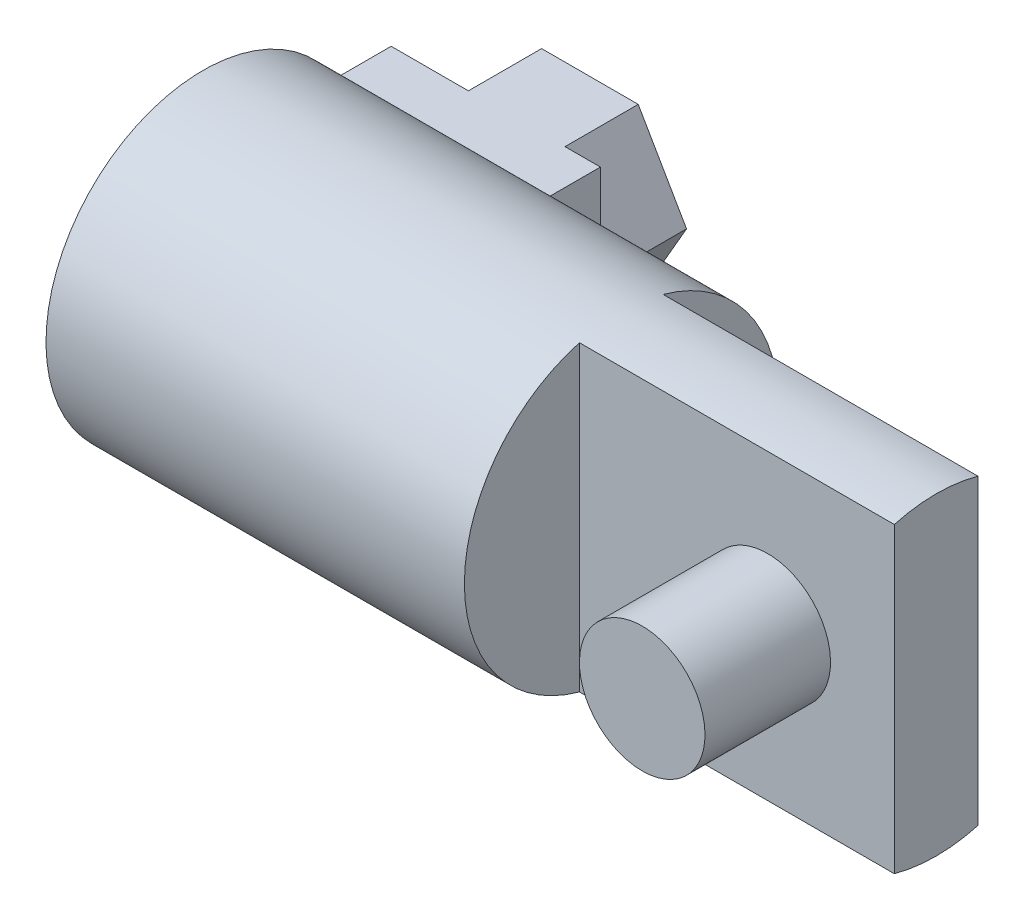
ISO-10303-21;
HEADER;
FILE_DESCRIPTION(('STEP AP214'),'2;1');
FILE_NAME('part.step','',(''),(''),'','','');
FILE_SCHEMA(('AUTOMOTIVE_DESIGN { 1 0 10303 214 1 1 1 1 }'));
ENDSEC;
DATA;
#1=APPLICATION_CONTEXT('core data for automotive mechanical design processes');
#2=APPLICATION_PROTOCOL_DEFINITION('international standard','automotive_design',2000,#1);
#3=PRODUCT_CONTEXT('',#1,'mechanical');
#4=PRODUCT('Part','Part','',(#3));
#5=PRODUCT_RELATED_PRODUCT_CATEGORY('part','',(#4));
#6=PRODUCT_DEFINITION_FORMATION('','',#4);
#7=PRODUCT_DEFINITION_CONTEXT('part definition',#1,'design');
#8=PRODUCT_DEFINITION('design','',#6,#7);
#9=PRODUCT_DEFINITION_SHAPE('','',#8);
#10=(LENGTH_UNIT() NAMED_UNIT(*) SI_UNIT(.MILLI.,.METRE.));
#11=(NAMED_UNIT(*) PLANE_ANGLE_UNIT() SI_UNIT($,.RADIAN.));
#12=(NAMED_UNIT(*) SI_UNIT($,.STERADIAN.) SOLID_ANGLE_UNIT());
#13=UNCERTAINTY_MEASURE_WITH_UNIT(LENGTH_MEASURE(1.E-05),#10,'distance_accuracy_value','');
#14=(GEOMETRIC_REPRESENTATION_CONTEXT(3) GLOBAL_UNCERTAINTY_ASSIGNED_CONTEXT((#13)) GLOBAL_UNIT_ASSIGNED_CONTEXT((#10,
#11,#12)) REPRESENTATION_CONTEXT('',''));
#15=CARTESIAN_POINT('',(0.,0.,0.));
#16=DIRECTION('',(0.,0.,1.));
#17=DIRECTION('',(1.,0.,0.));
#18=AXIS2_PLACEMENT_3D('',#15,#16,#17);
#19=CARTESIAN_POINT('',(-9.,10.,-4.));
#20=DIRECTION('',(0.,0.,1.));
#21=DIRECTION('',(0.,1.,0.));
#22=AXIS2_PLACEMENT_3D('',#19,#20,#21);
#23=PLANE('',#22);
#24=DIRECTION('',(1.,0.,0.));
#25=VECTOR('',#24,1.);
#26=CARTESIAN_POINT('',(50.,-7.22841614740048,-4.));
#27=LINE('',#26,#25);
#28=CARTESIAN_POINT('',(6.05,-7.22841614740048,-4.));
#29=VERTEX_POINT('',#28);
#30=CARTESIAN_POINT('',(-9.,-7.22841614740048,-4.));
#31=VERTEX_POINT('',#30);
#32=EDGE_CURVE('E231',#29,#31,#27,.F.);
#33=ORIENTED_EDGE('',*,*,#32,.T.);
#34=DIRECTION('',(0.,-1.,0.));
#35=VECTOR('',#34,1.);
#36=CARTESIAN_POINT('',(-9.,10.,-4.));
#37=LINE('',#36,#35);
#38=CARTESIAN_POINT('',(-9.,7.22841614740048,-4.));
#39=VERTEX_POINT('',#38);
#40=EDGE_CURVE('E245',#39,#31,#37,.T.);
#41=ORIENTED_EDGE('',*,*,#40,.F.);
#42=DIRECTION('',(1.,0.,0.));
#43=VECTOR('',#42,1.);
#44=CARTESIAN_POINT('',(50.,7.22841614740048,-4.));
#45=LINE('',#44,#43);
#46=CARTESIAN_POINT('',(6.05,7.22841614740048,-4.));
#47=VERTEX_POINT('',#46);
#48=EDGE_CURVE('E234',#39,#47,#45,.T.);
#49=ORIENTED_EDGE('',*,*,#48,.T.);
#50=DIRECTION('',(0.,-1.,0.));
#51=VECTOR('',#50,1.);
#52=CARTESIAN_POINT('',(6.05,10.,-4.));
#53=LINE('',#52,#51);
#54=EDGE_CURVE('E247',#47,#29,#53,.T.);
#55=ORIENTED_EDGE('',*,*,#54,.T.);
#56=EDGE_LOOP('',(#33,#41,#49,#55));
#57=FACE_BOUND('',#56,.T.);
#58=CARTESIAN_POINT('',(0.,0.,-4.));
#59=DIRECTION('',(0.,0.,1.));
#60=DIRECTION('',(0.,1.,0.));
#61=AXIS2_PLACEMENT_3D('',#58,#59,#60);
#62=CIRCLE('',#61,5.5);
#63=CARTESIAN_POINT('',(0.,5.5,-4.));
#64=VERTEX_POINT('',#63);
#65=EDGE_CURVE('E23',#64,#64,#62,.F.);
#66=ORIENTED_EDGE('',*,*,#65,.F.);
#67=EDGE_LOOP('',(#66));
#68=FACE_BOUND('',#67,.T.);
#69=ADVANCED_FACE('F14',(#57,#68),#23,.F.);
#70=CARTESIAN_POINT('',(-19.,-4.,-11.));
#71=DIRECTION('',(0.,0.,1.));
#72=DIRECTION('',(0.,1.,0.));
#73=AXIS2_PLACEMENT_3D('',#70,#71,#72);
#74=PLANE('',#73);
#75=DIRECTION('',(0.5,-0.866025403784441,0.));
#76=VECTOR('',#75,1.);
#77=CARTESIAN_POINT('',(-20.6905989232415,4.,-11.));
#78=LINE('',#77,#76);
#79=CARTESIAN_POINT('',(-20.6905989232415,4.,-11.));
#80=VERTEX_POINT('',#79);
#81=CARTESIAN_POINT('',(-19.,1.07179676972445,-11.));
#82=VERTEX_POINT('',#81);
#83=EDGE_CURVE('E39',#80,#82,#78,.T.);
#84=ORIENTED_EDGE('',*,*,#83,.F.);
#85=DIRECTION('',(-1.,0.,0.));
#86=VECTOR('',#85,1.);
#87=CARTESIAN_POINT('',(-19.,4.,-11.));
#88=LINE('',#87,#86);
#89=CARTESIAN_POINT('',(-19.,4.,-11.));
#90=VERTEX_POINT('',#89);
#91=EDGE_CURVE('E263',#90,#80,#88,.T.);
#92=ORIENTED_EDGE('',*,*,#91,.F.);
#93=DIRECTION('',(0.,-1.,0.));
#94=VECTOR('',#93,1.);
#95=CARTESIAN_POINT('',(-19.,4.,-11.));
#96=LINE('',#95,#94);
#97=EDGE_CURVE('E202',#90,#82,#96,.T.);
#98=ORIENTED_EDGE('',*,*,#97,.T.);
#99=EDGE_LOOP('',(#84,#92,#98));
#100=FACE_BOUND('',#99,.T.);
#101=ADVANCED_FACE('F284',(#100),#74,.F.);
#102=DIRECTION('',(1.,0.,0.));
#103=VECTOR('',#102,1.);
#104=CARTESIAN_POINT('',(-29.,-4.,-11.));
#105=LINE('',#104,#103);
#106=CARTESIAN_POINT('',(-20.6905989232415,-4.,-11.));
#107=VERTEX_POINT('',#106);
#108=CARTESIAN_POINT('',(-19.,-4.,-11.));
#109=VERTEX_POINT('',#108);
#110=EDGE_CURVE('E204',#107,#109,#105,.T.);
#111=ORIENTED_EDGE('',*,*,#110,.F.);
#112=DIRECTION('',(0.5,0.866025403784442,0.));
#113=VECTOR('',#112,1.);
#114=CARTESIAN_POINT('',(-20.6905989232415,-4.,-11.));
#115=LINE('',#114,#113);
#116=CARTESIAN_POINT('',(-19.,-1.07179676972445,-11.));
#117=VERTEX_POINT('',#116);
#118=EDGE_CURVE('E168',#107,#117,#115,.T.);
#119=ORIENTED_EDGE('',*,*,#118,.T.);
#120=EDGE_CURVE('E201',#117,#109,#96,.T.);
#121=ORIENTED_EDGE('',*,*,#120,.T.);
#122=EDGE_LOOP('',(#111,#119,#121));
#123=FACE_BOUND('',#122,.T.);
#124=ADVANCED_FACE('F286',(#123),#74,.F.);
#125=CARTESIAN_POINT('',(50.,0.,-2.));
#126=DIRECTION('',(1.,0.,0.));
#127=DIRECTION('',(0.,-1.,0.));
#128=AXIS2_PLACEMENT_3D('',#125,#126,#127);
#129=CYLINDRICAL_SURFACE('',#128,7.5);
#130=DIRECTION('',(1.,0.,0.));
#131=VECTOR('',#130,1.);
#132=CARTESIAN_POINT('',(50.,7.22841614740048,0.));
#133=LINE('',#132,#131);
#134=CARTESIAN_POINT('',(6.05,7.22841614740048,0.));
#135=VERTEX_POINT('',#134);
#136=CARTESIAN_POINT('',(-9.,7.22841614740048,0.));
#137=VERTEX_POINT('',#136);
#138=EDGE_CURVE('E223',#135,#137,#133,.F.);
#139=ORIENTED_EDGE('',*,*,#138,.F.);
#140=CARTESIAN_POINT('',(6.05,0.,-2.));
#141=DIRECTION('',(1.,0.,0.));
#142=DIRECTION('',(0.,-1.,0.));
#143=AXIS2_PLACEMENT_3D('',#140,#141,#142);
#144=CIRCLE('',#143,7.5);
#145=EDGE_CURVE('E241',#47,#135,#144,.T.);
#146=ORIENTED_EDGE('',*,*,#145,.F.);
#147=ORIENTED_EDGE('',*,*,#48,.F.);
#148=CARTESIAN_POINT('',(-9.,0.,-2.));
#149=DIRECTION('',(-1.,0.,0.));
#150=DIRECTION('',(0.,1.,0.));
#151=AXIS2_PLACEMENT_3D('',#148,#149,#150);
#152=CIRCLE('',#151,7.5);
#153=EDGE_CURVE('E236',#31,#39,#152,.F.);
#154=ORIENTED_EDGE('',*,*,#153,.F.);
#155=ORIENTED_EDGE('',*,*,#32,.F.);
#156=CARTESIAN_POINT('',(6.05,-7.22841614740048,0.));
#157=VERTEX_POINT('',#156);
#158=EDGE_CURVE('E244',#157,#29,#144,.T.);
#159=ORIENTED_EDGE('',*,*,#158,.F.);
#160=DIRECTION('',(1.,0.,0.));
#161=VECTOR('',#160,1.);
#162=CARTESIAN_POINT('',(50.,-7.22841614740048,0.));
#163=LINE('',#162,#161);
#164=CARTESIAN_POINT('',(-9.,-7.22841614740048,0.));
#165=VERTEX_POINT('',#164);
#166=EDGE_CURVE('E226',#165,#157,#163,.T.);
#167=ORIENTED_EDGE('',*,*,#166,.F.);
#168=CARTESIAN_POINT('',(-9.,0.,-2.));
#169=DIRECTION('',(1.,0.,0.));
#170=DIRECTION('',(0.,-1.,0.));
#171=AXIS2_PLACEMENT_3D('',#168,#169,#170);
#172=CIRCLE('',#171,7.5);
#173=EDGE_CURVE('E228',#165,#137,#172,.F.);
#174=ORIENTED_EDGE('',*,*,#173,.T.);
#175=EDGE_LOOP('',(#139,#146,#147,#154,#155,#159,#167,#174));
#176=FACE_BOUND('',#175,.T.);
#177=CARTESIAN_POINT('',(-19.,0.,-2.));
#178=DIRECTION('',(1.,0.,0.));
#179=DIRECTION('',(0.,-1.,0.));
#180=AXIS2_PLACEMENT_3D('',#177,#178,#179);
#181=CIRCLE('',#180,7.5);
#182=CARTESIAN_POINT('',(-19.,4.,-8.34428877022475));
#183=VERTEX_POINT('',#182);
#184=CARTESIAN_POINT('',(-19.,-4.,-8.34428877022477));
#185=VERTEX_POINT('',#184);
#186=EDGE_CURVE('E217',#183,#185,#181,.F.);
#187=ORIENTED_EDGE('',*,*,#186,.F.);
#188=DIRECTION('',(1.,0.,0.));
#189=VECTOR('',#188,1.);
#190=CARTESIAN_POINT('',(50.,4.,-8.34428877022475));
#191=LINE('',#190,#189);
#192=CARTESIAN_POINT('',(-29.,4.,-8.34428877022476));
#193=VERTEX_POINT('',#192);
#194=EDGE_CURVE('E214',#183,#193,#191,.F.);
#195=ORIENTED_EDGE('',*,*,#194,.T.);
#196=CARTESIAN_POINT('',(-29.,0.,-2.));
#197=DIRECTION('',(1.,0.,0.));
#198=DIRECTION('',(0.,-1.,0.));
#199=AXIS2_PLACEMENT_3D('',#196,#197,#198);
#200=CIRCLE('',#199,7.5);
#201=CARTESIAN_POINT('',(-29.,-4.,-8.34428877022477));
#202=VERTEX_POINT('',#201);
#203=EDGE_CURVE('E238',#193,#202,#200,.T.);
#204=ORIENTED_EDGE('',*,*,#203,.T.);
#205=DIRECTION('',(1.,0.,0.));
#206=VECTOR('',#205,1.);
#207=CARTESIAN_POINT('',(50.,-4.,-8.34428877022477));
#208=LINE('',#207,#206);
#209=EDGE_CURVE('E220',#202,#185,#208,.T.);
#210=ORIENTED_EDGE('',*,*,#209,.T.);
#211=EDGE_LOOP('',(#187,#195,#204,#210));
#212=FACE_BOUND('',#211,.T.);
#213=ADVANCED_FACE('F277',(#176,#212),#129,.T.);
#214=CARTESIAN_POINT('',(6.05,0.,-9.5));
#215=DIRECTION('',(-1.,0.,0.));
#216=DIRECTION('',(0.,1.,0.));
#217=AXIS2_PLACEMENT_3D('',#214,#215,#216);
#218=PLANE('',#217);
#219=ORIENTED_EDGE('',*,*,#145,.T.);
#220=DIRECTION('',(0.,1.,0.));
#221=VECTOR('',#220,1.);
#222=CARTESIAN_POINT('',(6.05,-10.,0.));
#223=LINE('',#222,#221);
#224=EDGE_CURVE('E252',#157,#135,#223,.T.);
#225=ORIENTED_EDGE('',*,*,#224,.F.);
#226=ORIENTED_EDGE('',*,*,#158,.T.);
#227=ORIENTED_EDGE('',*,*,#54,.F.);
#228=EDGE_LOOP('',(#219,#225,#226,#227));
#229=FACE_BOUND('',#228,.T.);
#230=ADVANCED_FACE('F16',(#229),#218,.F.);
#231=CARTESIAN_POINT('',(-29.,0.,-2.));
#232=DIRECTION('',(1.,0.,0.));
#233=DIRECTION('',(0.,-1.,0.));
#234=AXIS2_PLACEMENT_3D('',#231,#232,#233);
#235=PLANE('',#234);
#236=CARTESIAN_POINT('',(-29.,0.,-2.));
#237=DIRECTION('',(-1.,0.,0.));
#238=DIRECTION('',(0.,1.,0.));
#239=AXIS2_PLACEMENT_3D('',#236,#237,#238);
#240=CIRCLE('',#239,4.25);
#241=CARTESIAN_POINT('',(-29.,4.25,-2.));
#242=VERTEX_POINT('',#241);
#243=EDGE_CURVE('E158',#242,#242,#240,.T.);
#244=ORIENTED_EDGE('',*,*,#243,.F.);
#245=EDGE_LOOP('',(#244));
#246=FACE_BOUND('',#245,.T.);
#247=ORIENTED_EDGE('',*,*,#203,.F.);
#248=DIRECTION('',(0.,0.,-1.));
#249=VECTOR('',#248,1.);
#250=CARTESIAN_POINT('',(-29.,4.,-2.));
#251=LINE('',#250,#249);
#252=CARTESIAN_POINT('',(-29.,4.,-11.));
#253=VERTEX_POINT('',#252);
#254=EDGE_CURVE('E256',#193,#253,#251,.T.);
#255=ORIENTED_EDGE('',*,*,#254,.T.);
#256=DIRECTION('',(0.,1.,0.));
#257=VECTOR('',#256,1.);
#258=CARTESIAN_POINT('',(-29.,-4.,-11.));
#259=LINE('',#258,#257);
#260=CARTESIAN_POINT('',(-29.,-4.,-11.));
#261=VERTEX_POINT('',#260);
#262=EDGE_CURVE('E208',#261,#253,#259,.T.);
#263=ORIENTED_EDGE('',*,*,#262,.F.);
#264=DIRECTION('',(0.,0.,-1.));
#265=VECTOR('',#264,1.);
#266=CARTESIAN_POINT('',(-29.,-4.,-2.));
#267=LINE('',#266,#265);
#268=EDGE_CURVE('E259',#202,#261,#267,.T.);
#269=ORIENTED_EDGE('',*,*,#268,.F.);
#270=EDGE_LOOP('',(#247,#255,#263,#269));
#271=FACE_BOUND('',#270,.T.);
#272=ADVANCED_FACE('F272',(#246,#271),#235,.F.);
#273=CARTESIAN_POINT('',(-9.,10.,-12.));
#274=DIRECTION('',(-1.,0.,0.));
#275=DIRECTION('',(0.,1.,0.));
#276=AXIS2_PLACEMENT_3D('',#273,#274,#275);
#277=PLANE('',#276);
#278=ORIENTED_EDGE('',*,*,#153,.T.);
#279=ORIENTED_EDGE('',*,*,#40,.T.);
#280=EDGE_LOOP('',(#278,#279));
#281=FACE_BOUND('',#280,.T.);
#282=ADVANCED_FACE('F400',(#281),#277,.F.);
#283=CARTESIAN_POINT('',(-9.,-10.,0.));
#284=DIRECTION('',(0.,0.,-1.));
#285=DIRECTION('',(0.,-1.,0.));
#286=AXIS2_PLACEMENT_3D('',#283,#284,#285);
#287=PLANE('',#286);
#288=CARTESIAN_POINT('',(0.,0.,0.));
#289=DIRECTION('',(0.,0.,-1.));
#290=DIRECTION('',(0.,-1.,0.));
#291=AXIS2_PLACEMENT_3D('',#288,#289,#290);
#292=CIRCLE('',#291,3.);
#293=CARTESIAN_POINT('',(0.,-3.,0.));
#294=VERTEX_POINT('',#293);
#295=EDGE_CURVE('E18',#294,#294,#292,.T.);
#296=ORIENTED_EDGE('',*,*,#295,.T.);
#297=EDGE_LOOP('',(#296));
#298=FACE_BOUND('',#297,.T.);
#299=ORIENTED_EDGE('',*,*,#138,.T.);
#300=DIRECTION('',(0.,1.,0.));
#301=VECTOR('',#300,1.);
#302=CARTESIAN_POINT('',(-9.,-10.,0.));
#303=LINE('',#302,#301);
#304=EDGE_CURVE('E250',#165,#137,#303,.T.);
#305=ORIENTED_EDGE('',*,*,#304,.F.);
#306=ORIENTED_EDGE('',*,*,#166,.T.);
#307=ORIENTED_EDGE('',*,*,#224,.T.);
#308=EDGE_LOOP('',(#299,#305,#306,#307));
#309=FACE_BOUND('',#308,.T.);
#310=ADVANCED_FACE('F395',(#298,#309),#287,.F.);
#311=CARTESIAN_POINT('',(-9.,-10.,8.));
#312=DIRECTION('',(1.,0.,0.));
#313=DIRECTION('',(0.,-1.,0.));
#314=AXIS2_PLACEMENT_3D('',#311,#312,#313);
#315=PLANE('',#314);
#316=ORIENTED_EDGE('',*,*,#304,.T.);
#317=ORIENTED_EDGE('',*,*,#173,.F.);
#318=EDGE_LOOP('',(#316,#317));
#319=FACE_BOUND('',#318,.T.);
#320=ADVANCED_FACE('F399',(#319),#315,.T.);
#321=CARTESIAN_POINT('',(-19.,4.,-2.));
#322=DIRECTION('',(1.,0.,0.));
#323=DIRECTION('',(0.,-1.,0.));
#324=AXIS2_PLACEMENT_3D('',#321,#322,#323);
#325=PLANE('',#324);
#326=DIRECTION('',(0.,0.,-1.));
#327=VECTOR('',#326,1.);
#328=CARTESIAN_POINT('',(-19.,4.,-2.));
#329=LINE('',#328,#327);
#330=EDGE_CURVE('E254',#183,#90,#329,.T.);
#331=ORIENTED_EDGE('',*,*,#330,.F.);
#332=ORIENTED_EDGE('',*,*,#186,.T.);
#333=DIRECTION('',(0.,0.,-1.));
#334=VECTOR('',#333,1.);
#335=CARTESIAN_POINT('',(-19.,-4.,-2.));
#336=LINE('',#335,#334);
#337=EDGE_CURVE('E261',#185,#109,#336,.T.);
#338=ORIENTED_EDGE('',*,*,#337,.T.);
#339=ORIENTED_EDGE('',*,*,#120,.F.);
#340=EDGE_CURVE('E205',#82,#117,#96,.T.);
#341=ORIENTED_EDGE('',*,*,#340,.F.);
#342=ORIENTED_EDGE('',*,*,#97,.F.);
#343=EDGE_LOOP('',(#331,#332,#338,#339,#341,#342));
#344=FACE_BOUND('',#343,.T.);
#345=ADVANCED_FACE('F279',(#344),#325,.T.);
#346=CARTESIAN_POINT('',(-19.,4.,-2.));
#347=DIRECTION('',(0.,-1.,0.));
#348=DIRECTION('',(-1.,0.,0.));
#349=AXIS2_PLACEMENT_3D('',#346,#347,#348);
#350=PLANE('',#349);
#351=ORIENTED_EDGE('',*,*,#194,.F.);
#352=ORIENTED_EDGE('',*,*,#330,.T.);
#353=ORIENTED_EDGE('',*,*,#91,.T.);
#354=DIRECTION('',(0.,0.,1.));
#355=VECTOR('',#354,1.);
#356=CARTESIAN_POINT('',(-20.6905989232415,4.,-14.5));
#357=LINE('',#356,#355);
#358=CARTESIAN_POINT('',(-20.6905989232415,4.,-14.5));
#359=VERTEX_POINT('',#358);
#360=EDGE_CURVE('E194',#359,#80,#357,.T.);
#361=ORIENTED_EDGE('',*,*,#360,.F.);
#362=DIRECTION('',(-1.,0.,0.));
#363=VECTOR('',#362,1.);
#364=CARTESIAN_POINT('',(-20.6905989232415,4.,-14.5));
#365=LINE('',#364,#363);
#366=CARTESIAN_POINT('',(-25.3094010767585,4.,-14.5));
#367=VERTEX_POINT('',#366);
#368=EDGE_CURVE('E185',#359,#367,#365,.T.);
#369=ORIENTED_EDGE('',*,*,#368,.T.);
#370=DIRECTION('',(0.,0.,1.));
#371=VECTOR('',#370,1.);
#372=CARTESIAN_POINT('',(-25.3094010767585,4.,-14.5));
#373=LINE('',#372,#371);
#374=CARTESIAN_POINT('',(-25.3094010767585,4.,-11.));
#375=VERTEX_POINT('',#374);
#376=EDGE_CURVE('E142',#367,#375,#373,.T.);
#377=ORIENTED_EDGE('',*,*,#376,.T.);
#378=EDGE_CURVE('E31',#375,#253,#88,.T.);
#379=ORIENTED_EDGE('',*,*,#378,.T.);
#380=ORIENTED_EDGE('',*,*,#254,.F.);
#381=EDGE_LOOP('',(#351,#352,#353,#361,#369,#377,#379,#380));
#382=FACE_BOUND('',#381,.T.);
#383=ADVANCED_FACE('F273',(#382),#350,.F.);
#384=CARTESIAN_POINT('',(-29.,-4.,-2.));
#385=DIRECTION('',(0.,1.,0.));
#386=DIRECTION('',(1.,0.,0.));
#387=AXIS2_PLACEMENT_3D('',#384,#385,#386);
#388=PLANE('',#387);
#389=ORIENTED_EDGE('',*,*,#209,.F.);
#390=ORIENTED_EDGE('',*,*,#268,.T.);
#391=CARTESIAN_POINT('',(-25.3094010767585,-4.,-11.));
#392=VERTEX_POINT('',#391);
#393=EDGE_CURVE('E212',#261,#392,#105,.T.);
#394=ORIENTED_EDGE('',*,*,#393,.T.);
#395=DIRECTION('',(0.,0.,1.));
#396=VECTOR('',#395,1.);
#397=CARTESIAN_POINT('',(-25.3094010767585,-4.,-14.5));
#398=LINE('',#397,#396);
#399=CARTESIAN_POINT('',(-25.3094010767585,-4.,-14.5));
#400=VERTEX_POINT('',#399);
#401=EDGE_CURVE('E141',#400,#392,#398,.T.);
#402=ORIENTED_EDGE('',*,*,#401,.F.);
#403=DIRECTION('',(-1.,0.,0.));
#404=VECTOR('',#403,1.);
#405=CARTESIAN_POINT('',(-20.6905989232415,-4.,-14.5));
#406=LINE('',#405,#404);
#407=CARTESIAN_POINT('',(-20.6905989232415,-4.,-14.5));
#408=VERTEX_POINT('',#407);
#409=EDGE_CURVE('E171',#408,#400,#406,.T.);
#410=ORIENTED_EDGE('',*,*,#409,.F.);
#411=DIRECTION('',(0.,0.,1.));
#412=VECTOR('',#411,1.);
#413=CARTESIAN_POINT('',(-20.6905989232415,-4.,-14.5));
#414=LINE('',#413,#412);
#415=EDGE_CURVE('E161',#408,#107,#414,.T.);
#416=ORIENTED_EDGE('',*,*,#415,.T.);
#417=ORIENTED_EDGE('',*,*,#110,.T.);
#418=ORIENTED_EDGE('',*,*,#337,.F.);
#419=EDGE_LOOP('',(#389,#390,#394,#402,#410,#416,#417,#418));
#420=FACE_BOUND('',#419,.T.);
#421=ADVANCED_FACE('F301',(#420),#388,.F.);
#422=ORIENTED_EDGE('',*,*,#378,.F.);
#423=DIRECTION('',(-0.499999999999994,-0.866025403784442,0.));
#424=VECTOR('',#423,1.);
#425=CARTESIAN_POINT('',(-25.3094010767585,4.,-11.));
#426=LINE('',#425,#424);
#427=CARTESIAN_POINT('',(-27.618802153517,0.,-11.));
#428=VERTEX_POINT('',#427);
#429=EDGE_CURVE('E123',#375,#428,#426,.T.);
#430=ORIENTED_EDGE('',*,*,#429,.T.);
#431=DIRECTION('',(-0.5,0.866025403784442,0.));
#432=VECTOR('',#431,1.);
#433=CARTESIAN_POINT('',(-25.3094010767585,-4.,-11.));
#434=LINE('',#433,#432);
#435=EDGE_CURVE('E128',#392,#428,#434,.T.);
#436=ORIENTED_EDGE('',*,*,#435,.F.);
#437=ORIENTED_EDGE('',*,*,#393,.F.);
#438=ORIENTED_EDGE('',*,*,#262,.T.);
#439=EDGE_LOOP('',(#422,#430,#436,#437,#438));
#440=FACE_BOUND('',#439,.T.);
#441=ADVANCED_FACE('F125',(#440),#74,.F.);
#442=CARTESIAN_POINT('',(-14.,0.,-2.));
#443=DIRECTION('',(-1.,0.,0.));
#444=DIRECTION('',(0.,1.,0.));
#445=AXIS2_PLACEMENT_3D('',#442,#443,#444);
#446=CYLINDRICAL_SURFACE('',#445,4.25);
#447=CARTESIAN_POINT('',(-14.,0.,-2.));
#448=DIRECTION('',(-1.,0.,0.));
#449=DIRECTION('',(0.,1.,0.));
#450=AXIS2_PLACEMENT_3D('',#447,#448,#449);
#451=CIRCLE('',#450,4.25);
#452=CARTESIAN_POINT('',(-14.,4.25,-2.));
#453=VERTEX_POINT('',#452);
#454=EDGE_CURVE('E198',#453,#453,#451,.T.);
#455=ORIENTED_EDGE('',*,*,#454,.F.);
#456=EDGE_LOOP('',(#455));
#457=FACE_BOUND('',#456,.T.);
#458=ORIENTED_EDGE('',*,*,#243,.T.);
#459=EDGE_LOOP('',(#458));
#460=FACE_BOUND('',#459,.T.);
#461=ADVANCED_FACE('F300',(#457,#460),#446,.F.);
#462=CARTESIAN_POINT('',(-14.,0.,-2.));
#463=DIRECTION('',(-1.,0.,0.));
#464=DIRECTION('',(0.,1.,0.));
#465=AXIS2_PLACEMENT_3D('',#462,#463,#464);
#466=PLANE('',#465);
#467=ORIENTED_EDGE('',*,*,#454,.T.);
#468=EDGE_LOOP('',(#467));
#469=FACE_BOUND('',#468,.T.);
#470=ADVANCED_FACE('F302',(#469),#466,.T.);
#471=CARTESIAN_POINT('',(-25.3094010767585,-4.,-14.5));
#472=DIRECTION('',(0.866025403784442,0.5,0.));
#473=DIRECTION('',(0.5,-0.866025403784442,0.));
#474=AXIS2_PLACEMENT_3D('',#471,#472,#473);
#475=PLANE('',#474);
#476=DIRECTION('',(0.,0.,1.));
#477=VECTOR('',#476,1.);
#478=CARTESIAN_POINT('',(-27.618802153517,0.,-14.5));
#479=LINE('',#478,#477);
#480=CARTESIAN_POINT('',(-27.618802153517,0.,-14.5));
#481=VERTEX_POINT('',#480);
#482=EDGE_CURVE('E134',#481,#428,#479,.T.);
#483=ORIENTED_EDGE('',*,*,#482,.F.);
#484=DIRECTION('',(-0.5,0.866025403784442,0.));
#485=VECTOR('',#484,1.);
#486=CARTESIAN_POINT('',(-25.3094010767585,-4.,-14.5));
#487=LINE('',#486,#485);
#488=EDGE_CURVE('E182',#400,#481,#487,.T.);
#489=ORIENTED_EDGE('',*,*,#488,.F.);
#490=ORIENTED_EDGE('',*,*,#401,.T.);
#491=ORIENTED_EDGE('',*,*,#435,.T.);
#492=EDGE_LOOP('',(#483,#489,#490,#491));
#493=FACE_BOUND('',#492,.T.);
#494=ADVANCED_FACE('F145',(#493),#475,.F.);
#495=CARTESIAN_POINT('',(-25.3094010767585,4.,-14.5));
#496=DIRECTION('',(-0.866025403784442,0.499999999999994,0.));
#497=DIRECTION('',(0.499999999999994,0.866025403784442,0.));
#498=AXIS2_PLACEMENT_3D('',#495,#496,#497);
#499=PLANE('',#498);
#500=ORIENTED_EDGE('',*,*,#376,.F.);
#501=DIRECTION('',(-0.499999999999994,-0.866025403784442,0.));
#502=VECTOR('',#501,1.);
#503=CARTESIAN_POINT('',(-25.3094010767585,4.,-14.5));
#504=LINE('',#503,#502);
#505=EDGE_CURVE('E137',#367,#481,#504,.T.);
#506=ORIENTED_EDGE('',*,*,#505,.T.);
#507=ORIENTED_EDGE('',*,*,#482,.T.);
#508=ORIENTED_EDGE('',*,*,#429,.F.);
#509=EDGE_LOOP('',(#500,#506,#507,#508));
#510=FACE_BOUND('',#509,.T.);
#511=ADVANCED_FACE('F135',(#510),#499,.T.);
#512=CARTESIAN_POINT('',(-20.6905989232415,4.,-14.5));
#513=DIRECTION('',(-0.866025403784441,-0.5,0.));
#514=DIRECTION('',(-0.5,0.866025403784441,0.));
#515=AXIS2_PLACEMENT_3D('',#512,#513,#514);
#516=PLANE('',#515);
#517=DIRECTION('',(0.,0.,1.));
#518=VECTOR('',#517,1.);
#519=CARTESIAN_POINT('',(-18.381197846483,0.,-14.5));
#520=LINE('',#519,#518);
#521=CARTESIAN_POINT('',(-18.381197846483,0.,-14.5));
#522=VERTEX_POINT('',#521);
#523=CARTESIAN_POINT('',(-18.381197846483,0.,-11.));
#524=VERTEX_POINT('',#523);
#525=EDGE_CURVE('E164',#522,#524,#520,.T.);
#526=ORIENTED_EDGE('',*,*,#525,.F.);
#527=DIRECTION('',(0.5,-0.866025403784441,0.));
#528=VECTOR('',#527,1.);
#529=CARTESIAN_POINT('',(-20.6905989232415,4.,-14.5));
#530=LINE('',#529,#528);
#531=EDGE_CURVE('E188',#359,#522,#530,.T.);
#532=ORIENTED_EDGE('',*,*,#531,.F.);
#533=ORIENTED_EDGE('',*,*,#360,.T.);
#534=ORIENTED_EDGE('',*,*,#83,.T.);
#535=EDGE_CURVE('E131',#82,#524,#78,.T.);
#536=ORIENTED_EDGE('',*,*,#535,.T.);
#537=EDGE_LOOP('',(#526,#532,#533,#534,#536));
#538=FACE_BOUND('',#537,.T.);
#539=ADVANCED_FACE('F322',(#538),#516,.F.);
#540=CARTESIAN_POINT('',(-20.6905989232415,-4.,-14.5));
#541=DIRECTION('',(0.866025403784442,-0.5,0.));
#542=DIRECTION('',(-0.5,-0.866025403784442,0.));
#543=AXIS2_PLACEMENT_3D('',#540,#541,#542);
#544=PLANE('',#543);
#545=DIRECTION('',(0.5,0.866025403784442,0.));
#546=VECTOR('',#545,1.);
#547=CARTESIAN_POINT('',(-20.6905989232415,-4.,-14.5));
#548=LINE('',#547,#546);
#549=EDGE_CURVE('E165',#408,#522,#548,.T.);
#550=ORIENTED_EDGE('',*,*,#549,.T.);
#551=ORIENTED_EDGE('',*,*,#525,.T.);
#552=EDGE_CURVE('E172',#117,#524,#115,.T.);
#553=ORIENTED_EDGE('',*,*,#552,.F.);
#554=ORIENTED_EDGE('',*,*,#118,.F.);
#555=ORIENTED_EDGE('',*,*,#415,.F.);
#556=EDGE_LOOP('',(#550,#551,#553,#554,#555));
#557=FACE_BOUND('',#556,.T.);
#558=ADVANCED_FACE('F325',(#557),#544,.T.);
#559=CARTESIAN_POINT('',(-29.9282032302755,-4.,-14.5));
#560=DIRECTION('',(0.,0.,1.));
#561=DIRECTION('',(0.,1.,0.));
#562=AXIS2_PLACEMENT_3D('',#559,#560,#561);
#563=PLANE('',#562);
#564=ORIENTED_EDGE('',*,*,#409,.T.);
#565=ORIENTED_EDGE('',*,*,#488,.T.);
#566=ORIENTED_EDGE('',*,*,#505,.F.);
#567=ORIENTED_EDGE('',*,*,#368,.F.);
#568=ORIENTED_EDGE('',*,*,#531,.T.);
#569=ORIENTED_EDGE('',*,*,#549,.F.);
#570=EDGE_LOOP('',(#564,#565,#566,#567,#568,#569));
#571=FACE_BOUND('',#570,.T.);
#572=ADVANCED_FACE('F327',(#571),#563,.F.);
#573=CARTESIAN_POINT('',(-29.9282032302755,-4.,-11.));
#574=DIRECTION('',(0.,0.,1.));
#575=DIRECTION('',(0.,1.,0.));
#576=AXIS2_PLACEMENT_3D('',#573,#574,#575);
#577=PLANE('',#576);
#578=ORIENTED_EDGE('',*,*,#535,.F.);
#579=ORIENTED_EDGE('',*,*,#340,.T.);
#580=ORIENTED_EDGE('',*,*,#552,.T.);
#581=EDGE_LOOP('',(#578,#579,#580));
#582=FACE_BOUND('',#581,.T.);
#583=ADVANCED_FACE('F331',(#582),#577,.T.);
#584=CARTESIAN_POINT('',(0.,0.,-4.5));
#585=DIRECTION('',(0.,0.,1.));
#586=DIRECTION('',(0.,1.,0.));
#587=AXIS2_PLACEMENT_3D('',#584,#585,#586);
#588=CYLINDRICAL_SURFACE('',#587,5.5);
#589=CARTESIAN_POINT('',(0.,0.,-4.5));
#590=DIRECTION('',(0.,0.,-1.));
#591=DIRECTION('',(0.,-1.,0.));
#592=AXIS2_PLACEMENT_3D('',#589,#590,#591);
#593=CIRCLE('',#592,5.5);
#594=CARTESIAN_POINT('',(0.,-5.5,-4.5));
#595=VERTEX_POINT('',#594);
#596=EDGE_CURVE('E146',#595,#595,#593,.T.);
#597=ORIENTED_EDGE('',*,*,#596,.F.);
#598=EDGE_LOOP('',(#597));
#599=FACE_BOUND('',#598,.T.);
#600=ORIENTED_EDGE('',*,*,#65,.T.);
#601=EDGE_LOOP('',(#600));
#602=FACE_BOUND('',#601,.T.);
#603=ADVANCED_FACE('F337',(#599,#602),#588,.T.);
#604=CARTESIAN_POINT('',(0.,0.,-4.5));
#605=DIRECTION('',(0.,0.,-1.));
#606=DIRECTION('',(0.,-1.,0.));
#607=AXIS2_PLACEMENT_3D('',#604,#605,#606);
#608=PLANE('',#607);
#609=CARTESIAN_POINT('',(0.,0.,-4.5));
#610=DIRECTION('',(0.,0.,-1.));
#611=DIRECTION('',(0.,-1.,0.));
#612=AXIS2_PLACEMENT_3D('',#609,#610,#611);
#613=CIRCLE('',#612,3.);
#614=CARTESIAN_POINT('',(0.,-3.,-4.5));
#615=VERTEX_POINT('',#614);
#616=EDGE_CURVE('E9',#615,#615,#613,.T.);
#617=ORIENTED_EDGE('',*,*,#616,.F.);
#618=EDGE_LOOP('',(#617));
#619=FACE_BOUND('',#618,.T.);
#620=ORIENTED_EDGE('',*,*,#596,.T.);
#621=EDGE_LOOP('',(#620));
#622=FACE_BOUND('',#621,.T.);
#623=ADVANCED_FACE('F339',(#619,#622),#608,.T.);
#624=CARTESIAN_POINT('',(0.,0.,-6.5));
#625=DIRECTION('',(0.,0.,1.));
#626=DIRECTION('',(0.,1.,0.));
#627=AXIS2_PLACEMENT_3D('',#624,#625,#626);
#628=CYLINDRICAL_SURFACE('',#627,3.);
#629=CARTESIAN_POINT('',(0.,0.,-6.5));
#630=DIRECTION('',(0.,0.,-1.));
#631=DIRECTION('',(0.,-1.,0.));
#632=AXIS2_PLACEMENT_3D('',#629,#630,#631);
#633=CIRCLE('',#632,3.);
#634=CARTESIAN_POINT('',(0.,-3.,-6.5));
#635=VERTEX_POINT('',#634);
#636=EDGE_CURVE('E149',#635,#635,#633,.T.);
#637=ORIENTED_EDGE('',*,*,#636,.F.);
#638=EDGE_LOOP('',(#637));
#639=FACE_BOUND('',#638,.T.);
#640=ORIENTED_EDGE('',*,*,#616,.T.);
#641=EDGE_LOOP('',(#640));
#642=FACE_BOUND('',#641,.T.);
#643=ADVANCED_FACE('F346',(#639,#642),#628,.T.);
#644=CARTESIAN_POINT('',(0.,0.,-6.5));
#645=DIRECTION('',(0.,0.,-1.));
#646=DIRECTION('',(0.,-1.,0.));
#647=AXIS2_PLACEMENT_3D('',#644,#645,#646);
#648=PLANE('',#647);
#649=ORIENTED_EDGE('',*,*,#636,.T.);
#650=EDGE_LOOP('',(#649));
#651=FACE_BOUND('',#650,.T.);
#652=ADVANCED_FACE('F343',(#651),#648,.T.);
#653=CARTESIAN_POINT('',(0.,0.,6.));
#654=DIRECTION('',(0.,0.,-1.));
#655=DIRECTION('',(0.,-1.,0.));
#656=AXIS2_PLACEMENT_3D('',#653,#654,#655);
#657=CYLINDRICAL_SURFACE('',#656,3.);
#658=CARTESIAN_POINT('',(0.,0.,6.));
#659=DIRECTION('',(0.,0.,-1.));
#660=DIRECTION('',(0.,-1.,0.));
#661=AXIS2_PLACEMENT_3D('',#658,#659,#660);
#662=CIRCLE('',#661,3.);
#663=CARTESIAN_POINT('',(0.,-3.,6.));
#664=VERTEX_POINT('',#663);
#665=EDGE_CURVE('E366',#664,#664,#662,.T.);
#666=ORIENTED_EDGE('',*,*,#665,.T.);
#667=EDGE_LOOP('',(#666));
#668=FACE_BOUND('',#667,.T.);
#669=ORIENTED_EDGE('',*,*,#295,.F.);
#670=EDGE_LOOP('',(#669));
#671=FACE_BOUND('',#670,.T.);
#672=ADVANCED_FACE('F351',(#668,#671),#657,.T.);
#673=CARTESIAN_POINT('',(0.,0.,6.));
#674=DIRECTION('',(0.,0.,-1.));
#675=DIRECTION('',(0.,-1.,0.));
#676=AXIS2_PLACEMENT_3D('',#673,#674,#675);
#677=PLANE('',#676);
#678=ORIENTED_EDGE('',*,*,#665,.F.);
#679=EDGE_LOOP('',(#678));
#680=FACE_BOUND('',#679,.T.);
#681=ADVANCED_FACE('F357',(#680),#677,.F.);
#682=CLOSED_SHELL('',(#69,#101,#124,#213,#230,#272,#282,#310,#320,#345,#383,#421,#441,#461,#470,
#494,#511,#539,#558,#572,#583,#603,#623,#643,#652,#672,#681));
#683=MANIFOLD_SOLID_BREP('B1',#682);
#684=ADVANCED_BREP_SHAPE_REPRESENTATION('',(#18,#683),#14);
#685=SHAPE_DEFINITION_REPRESENTATION(#9,#684);
ENDSEC;
END-ISO-10303-21;
